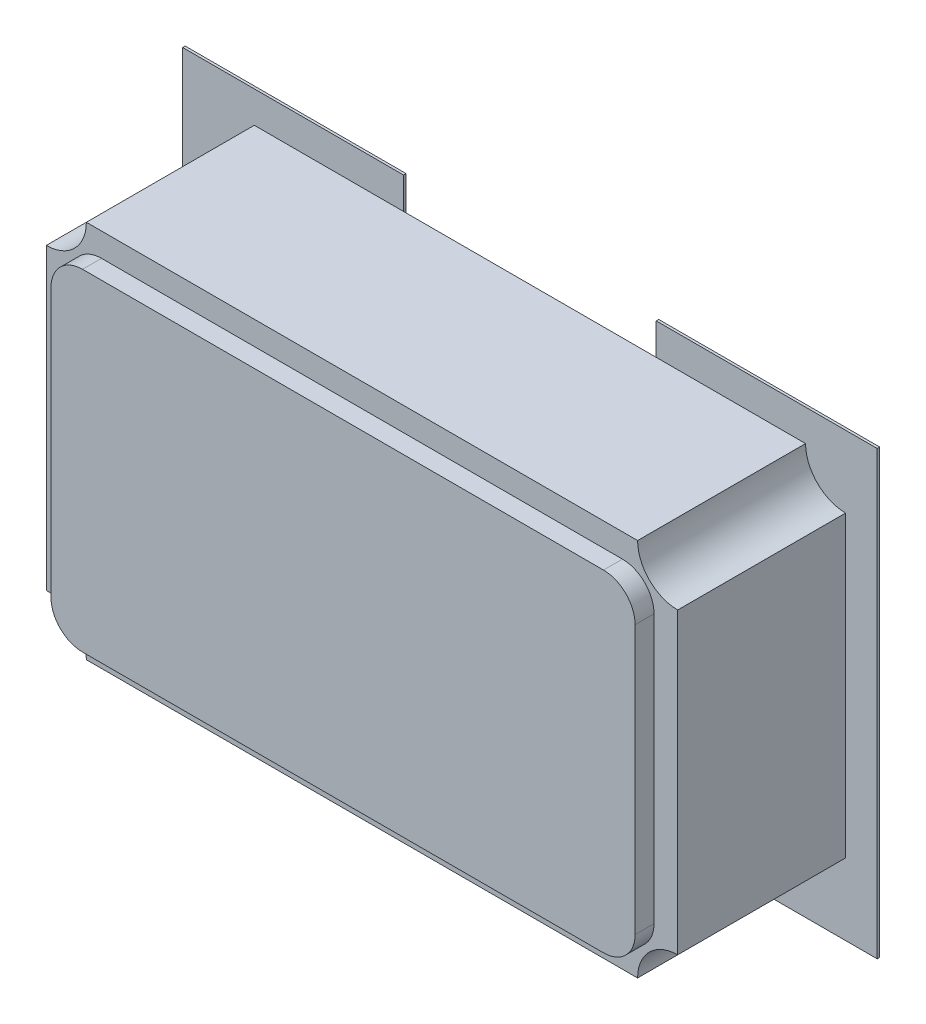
ISO-10303-21;
HEADER;
FILE_DESCRIPTION(('STEP AP214'),'2;1');
FILE_NAME('part.step','',(''),(''),'','','');
FILE_SCHEMA(('AUTOMOTIVE_DESIGN { 1 0 10303 214 1 1 1 1 }'));
ENDSEC;
DATA;
#1=APPLICATION_CONTEXT('core data for automotive mechanical design processes');
#2=APPLICATION_PROTOCOL_DEFINITION('international standard','automotive_design',2000,#1);
#3=PRODUCT_CONTEXT('',#1,'mechanical');
#4=PRODUCT('Part','Part','',(#3));
#5=PRODUCT_RELATED_PRODUCT_CATEGORY('part','',(#4));
#6=PRODUCT_DEFINITION_FORMATION('','',#4);
#7=PRODUCT_DEFINITION_CONTEXT('part definition',#1,'design');
#8=PRODUCT_DEFINITION('design','',#6,#7);
#9=PRODUCT_DEFINITION_SHAPE('','',#8);
#10=(LENGTH_UNIT() NAMED_UNIT(*) SI_UNIT(.MILLI.,.METRE.));
#11=(NAMED_UNIT(*) PLANE_ANGLE_UNIT() SI_UNIT($,.RADIAN.));
#12=(NAMED_UNIT(*) SI_UNIT($,.STERADIAN.) SOLID_ANGLE_UNIT());
#13=UNCERTAINTY_MEASURE_WITH_UNIT(LENGTH_MEASURE(1.E-05),#10,'distance_accuracy_value','');
#14=(GEOMETRIC_REPRESENTATION_CONTEXT(3) GLOBAL_UNCERTAINTY_ASSIGNED_CONTEXT((#13)) GLOBAL_UNIT_ASSIGNED_CONTEXT((#10,
#11,#12)) REPRESENTATION_CONTEXT('',''));
#15=CARTESIAN_POINT('',(0.,0.,0.));
#16=DIRECTION('',(0.,0.,1.));
#17=DIRECTION('',(1.,0.,0.));
#18=AXIS2_PLACEMENT_3D('',#15,#16,#17);
#19=CARTESIAN_POINT('',(0.,0.,0.0762));
#20=DIRECTION('',(0.,0.,1.));
#21=DIRECTION('',(1.,0.,0.));
#22=AXIS2_PLACEMENT_3D('',#19,#20,#21);
#23=PLANE('',#22);
#24=DIRECTION('',(0.,1.,0.));
#25=VECTOR('',#24,1.);
#26=CARTESIAN_POINT('',(1.09999999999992,0.699999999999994,0.0762));
#27=LINE('',#26,#25);
#28=CARTESIAN_POINT('',(1.09999999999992,-0.699999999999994,0.0762));
#29=VERTEX_POINT('',#28);
#30=CARTESIAN_POINT('',(1.09999999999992,0.699999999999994,0.0762));
#31=VERTEX_POINT('',#30);
#32=EDGE_CURVE('E171',#29,#31,#27,.T.);
#33=ORIENTED_EDGE('',*,*,#32,.F.);
#34=DIRECTION('',(1.,0.,0.));
#35=VECTOR('',#34,1.);
#36=CARTESIAN_POINT('',(1.09999999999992,-0.699999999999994,0.0762));
#37=LINE('',#36,#35);
#38=CARTESIAN_POINT('',(0.399999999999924,-0.699999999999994,0.0762));
#39=VERTEX_POINT('',#38);
#40=EDGE_CURVE('E193',#39,#29,#37,.T.);
#41=ORIENTED_EDGE('',*,*,#40,.F.);
#42=DIRECTION('',(0.,1.,0.));
#43=VECTOR('',#42,1.);
#44=CARTESIAN_POINT('',(0.399999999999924,-0.699999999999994,0.0762));
#45=LINE('',#44,#43);
#46=CARTESIAN_POINT('',(0.399999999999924,0.699999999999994,0.0762));
#47=VERTEX_POINT('',#46);
#48=EDGE_CURVE('E174',#47,#39,#45,.F.);
#49=ORIENTED_EDGE('',*,*,#48,.F.);
#50=DIRECTION('',(1.,0.,0.));
#51=VECTOR('',#50,1.);
#52=CARTESIAN_POINT('',(0.399999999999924,0.699999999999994,0.0762));
#53=LINE('',#52,#51);
#54=EDGE_CURVE('E168',#31,#47,#53,.F.);
#55=ORIENTED_EDGE('',*,*,#54,.F.);
#56=EDGE_LOOP('',(#33,#41,#49,#55));
#57=FACE_BOUND('',#56,.T.);
#58=ADVANCED_FACE('F16',(#57),#23,.F.);
#59=CARTESIAN_POINT('',(0.,0.,0.0762));
#60=DIRECTION('',(0.,0.,1.));
#61=DIRECTION('',(1.,0.,0.));
#62=AXIS2_PLACEMENT_3D('',#59,#60,#61);
#63=PLANE('',#62);
#64=DIRECTION('',(0.,1.,0.));
#65=VECTOR('',#64,1.);
#66=CARTESIAN_POINT('',(-1.09999999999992,-0.699999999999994,0.0762));
#67=LINE('',#66,#65);
#68=CARTESIAN_POINT('',(-1.09999999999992,0.699999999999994,0.0762));
#69=VERTEX_POINT('',#68);
#70=CARTESIAN_POINT('',(-1.09999999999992,-0.699999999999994,0.0762));
#71=VERTEX_POINT('',#70);
#72=EDGE_CURVE('E330',#69,#71,#67,.F.);
#73=ORIENTED_EDGE('',*,*,#72,.F.);
#74=DIRECTION('',(1.,0.,0.));
#75=VECTOR('',#74,1.);
#76=CARTESIAN_POINT('',(0.,0.699999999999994,0.0762));
#77=LINE('',#76,#75);
#78=CARTESIAN_POINT('',(-0.399999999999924,0.699999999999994,0.0762));
#79=VERTEX_POINT('',#78);
#80=EDGE_CURVE('E179',#79,#69,#77,.F.);
#81=ORIENTED_EDGE('',*,*,#80,.F.);
#82=DIRECTION('',(0.,1.,0.));
#83=VECTOR('',#82,1.);
#84=CARTESIAN_POINT('',(-0.399999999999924,0.699999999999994,0.0762));
#85=LINE('',#84,#83);
#86=CARTESIAN_POINT('',(-0.399999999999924,-0.699999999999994,0.0762));
#87=VERTEX_POINT('',#86);
#88=EDGE_CURVE('E340',#87,#79,#85,.T.);
#89=ORIENTED_EDGE('',*,*,#88,.F.);
#90=DIRECTION('',(1.,0.,0.));
#91=VECTOR('',#90,1.);
#92=CARTESIAN_POINT('',(-0.399999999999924,-0.699999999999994,0.0762));
#93=LINE('',#92,#91);
#94=EDGE_CURVE('E336',#71,#87,#93,.T.);
#95=ORIENTED_EDGE('',*,*,#94,.F.);
#96=EDGE_LOOP('',(#73,#81,#89,#95));
#97=FACE_BOUND('',#96,.T.);
#98=ADVANCED_FACE('F760',(#97),#63,.F.);
#99=CARTESIAN_POINT('',(0.399999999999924,0.699999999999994,0.0762));
#100=DIRECTION('',(0.,1.,0.));
#101=DIRECTION('',(0.,0.,1.));
#102=AXIS2_PLACEMENT_3D('',#99,#100,#101);
#103=PLANE('',#102);
#104=DIRECTION('',(0.,0.,-1.));
#105=VECTOR('',#104,1.);
#106=CARTESIAN_POINT('',(1.09999999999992,0.699999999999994,0.0762));
#107=LINE('',#106,#105);
#108=CARTESIAN_POINT('',(1.09999999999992,0.699999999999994,0.0841999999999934));
#109=VERTEX_POINT('',#108);
#110=EDGE_CURVE('E178',#31,#109,#107,.F.);
#111=ORIENTED_EDGE('',*,*,#110,.F.);
#112=ORIENTED_EDGE('',*,*,#54,.T.);
#113=DIRECTION('',(0.,0.,1.));
#114=VECTOR('',#113,1.);
#115=CARTESIAN_POINT('',(0.399999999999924,0.699999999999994,0.0762));
#116=LINE('',#115,#114);
#117=CARTESIAN_POINT('',(0.399999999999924,0.699999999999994,0.0841999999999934));
#118=VERTEX_POINT('',#117);
#119=EDGE_CURVE('E346',#118,#47,#116,.F.);
#120=ORIENTED_EDGE('',*,*,#119,.F.);
#121=DIRECTION('',(-1.,0.,0.));
#122=VECTOR('',#121,1.);
#123=CARTESIAN_POINT('',(0.,0.699999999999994,0.0841999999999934));
#124=LINE('',#123,#122);
#125=EDGE_CURVE('E184',#118,#109,#124,.F.);
#126=ORIENTED_EDGE('',*,*,#125,.T.);
#127=EDGE_LOOP('',(#111,#112,#120,#126));
#128=FACE_BOUND('',#127,.T.);
#129=ADVANCED_FACE('F182',(#128),#103,.T.);
#130=CARTESIAN_POINT('',(1.09999999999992,0.699999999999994,0.0762));
#131=DIRECTION('',(1.,0.,0.));
#132=DIRECTION('',(0.,0.,-1.));
#133=AXIS2_PLACEMENT_3D('',#130,#131,#132);
#134=PLANE('',#133);
#135=DIRECTION('',(0.,0.,-1.));
#136=VECTOR('',#135,1.);
#137=CARTESIAN_POINT('',(1.09999999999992,-0.699999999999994,0.0762));
#138=LINE('',#137,#136);
#139=CARTESIAN_POINT('',(1.09999999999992,-0.699999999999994,0.0841999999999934));
#140=VERTEX_POINT('',#139);
#141=EDGE_CURVE('E190',#29,#140,#138,.F.);
#142=ORIENTED_EDGE('',*,*,#141,.F.);
#143=ORIENTED_EDGE('',*,*,#32,.T.);
#144=ORIENTED_EDGE('',*,*,#110,.T.);
#145=DIRECTION('',(0.,1.,0.));
#146=VECTOR('',#145,1.);
#147=CARTESIAN_POINT('',(1.09999999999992,0.,0.0841999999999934));
#148=LINE('',#147,#146);
#149=EDGE_CURVE('E359',#109,#140,#148,.F.);
#150=ORIENTED_EDGE('',*,*,#149,.T.);
#151=EDGE_LOOP('',(#142,#143,#144,#150));
#152=FACE_BOUND('',#151,.T.);
#153=ADVANCED_FACE('F188',(#152),#134,.T.);
#154=CARTESIAN_POINT('',(1.09999999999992,-0.699999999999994,0.0762));
#155=DIRECTION('',(0.,-1.,0.));
#156=DIRECTION('',(0.,0.,-1.));
#157=AXIS2_PLACEMENT_3D('',#154,#155,#156);
#158=PLANE('',#157);
#159=DIRECTION('',(0.,0.,1.));
#160=VECTOR('',#159,1.);
#161=CARTESIAN_POINT('',(0.399999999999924,-0.699999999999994,0.0762));
#162=LINE('',#161,#160);
#163=CARTESIAN_POINT('',(0.399999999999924,-0.699999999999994,0.0841999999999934));
#164=VERTEX_POINT('',#163);
#165=EDGE_CURVE('E352',#39,#164,#162,.T.);
#166=ORIENTED_EDGE('',*,*,#165,.F.);
#167=ORIENTED_EDGE('',*,*,#40,.T.);
#168=ORIENTED_EDGE('',*,*,#141,.T.);
#169=DIRECTION('',(-1.,0.,0.));
#170=VECTOR('',#169,1.);
#171=CARTESIAN_POINT('',(0.,-0.699999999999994,0.0841999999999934));
#172=LINE('',#171,#170);
#173=EDGE_CURVE('E319',#140,#164,#172,.T.);
#174=ORIENTED_EDGE('',*,*,#173,.T.);
#175=EDGE_LOOP('',(#166,#167,#168,#174));
#176=FACE_BOUND('',#175,.T.);
#177=ADVANCED_FACE('F430',(#176),#158,.T.);
#178=CARTESIAN_POINT('',(-0.399999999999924,0.699999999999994,0.0762));
#179=DIRECTION('',(1.,0.,0.));
#180=DIRECTION('',(0.,0.,-1.));
#181=AXIS2_PLACEMENT_3D('',#178,#179,#180);
#182=PLANE('',#181);
#183=DIRECTION('',(0.,1.,0.));
#184=VECTOR('',#183,1.);
#185=CARTESIAN_POINT('',(-0.399999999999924,0.,0.0841999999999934));
#186=LINE('',#185,#184);
#187=CARTESIAN_POINT('',(-0.399999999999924,-0.599999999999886,0.0841999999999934));
#188=VERTEX_POINT('',#187);
#189=CARTESIAN_POINT('',(-0.399999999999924,0.599999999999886,0.0841999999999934));
#190=VERTEX_POINT('',#189);
#191=EDGE_CURVE('E283',#188,#190,#186,.T.);
#192=ORIENTED_EDGE('',*,*,#191,.F.);
#193=DIRECTION('',(0.,1.,0.));
#194=VECTOR('',#193,1.);
#195=CARTESIAN_POINT('',(-0.399999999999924,0.699999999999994,0.0841999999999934));
#196=LINE('',#195,#194);
#197=CARTESIAN_POINT('',(-0.399999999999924,-0.699999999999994,0.0841999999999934));
#198=VERTEX_POINT('',#197);
#199=EDGE_CURVE('E343',#188,#198,#196,.F.);
#200=ORIENTED_EDGE('',*,*,#199,.T.);
#201=DIRECTION('',(0.,0.,-1.));
#202=VECTOR('',#201,1.);
#203=CARTESIAN_POINT('',(-0.399999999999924,-0.699999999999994,0.0762));
#204=LINE('',#203,#202);
#205=EDGE_CURVE('E339',#87,#198,#204,.F.);
#206=ORIENTED_EDGE('',*,*,#205,.F.);
#207=ORIENTED_EDGE('',*,*,#88,.T.);
#208=DIRECTION('',(0.,0.,1.));
#209=VECTOR('',#208,1.);
#210=CARTESIAN_POINT('',(-0.399999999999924,0.699999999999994,0.0762));
#211=LINE('',#210,#209);
#212=CARTESIAN_POINT('',(-0.399999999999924,0.699999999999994,0.0841999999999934));
#213=VERTEX_POINT('',#212);
#214=EDGE_CURVE('E329',#213,#79,#211,.F.);
#215=ORIENTED_EDGE('',*,*,#214,.F.);
#216=DIRECTION('',(0.,1.,0.));
#217=VECTOR('',#216,1.);
#218=CARTESIAN_POINT('',(-0.399999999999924,0.699999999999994,0.0841999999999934));
#219=LINE('',#218,#217);
#220=EDGE_CURVE('E140',#213,#190,#219,.F.);
#221=ORIENTED_EDGE('',*,*,#220,.T.);
#222=EDGE_LOOP('',(#192,#200,#206,#207,#215,#221));
#223=FACE_BOUND('',#222,.T.);
#224=ADVANCED_FACE('F445',(#223),#182,.T.);
#225=CARTESIAN_POINT('',(0.399999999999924,-0.699999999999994,0.0762));
#226=DIRECTION('',(-1.,0.,0.));
#227=DIRECTION('',(0.,0.,1.));
#228=AXIS2_PLACEMENT_3D('',#225,#226,#227);
#229=PLANE('',#228);
#230=DIRECTION('',(0.,1.,0.));
#231=VECTOR('',#230,1.);
#232=CARTESIAN_POINT('',(0.399999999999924,0.,0.0841999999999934));
#233=LINE('',#232,#231);
#234=CARTESIAN_POINT('',(0.399999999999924,0.599999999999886,0.0841999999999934));
#235=VERTEX_POINT('',#234);
#236=CARTESIAN_POINT('',(0.399999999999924,-0.599999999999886,0.0841999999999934));
#237=VERTEX_POINT('',#236);
#238=EDGE_CURVE('E286',#235,#237,#233,.F.);
#239=ORIENTED_EDGE('',*,*,#238,.F.);
#240=DIRECTION('',(0.,1.,0.));
#241=VECTOR('',#240,1.);
#242=CARTESIAN_POINT('',(0.399999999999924,0.,0.0841999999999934));
#243=LINE('',#242,#241);
#244=EDGE_CURVE('E300',#235,#118,#243,.T.);
#245=ORIENTED_EDGE('',*,*,#244,.T.);
#246=ORIENTED_EDGE('',*,*,#119,.T.);
#247=ORIENTED_EDGE('',*,*,#48,.T.);
#248=ORIENTED_EDGE('',*,*,#165,.T.);
#249=DIRECTION('',(0.,1.,0.));
#250=VECTOR('',#249,1.);
#251=CARTESIAN_POINT('',(0.399999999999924,0.,0.0841999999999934));
#252=LINE('',#251,#250);
#253=EDGE_CURVE('E287',#164,#237,#252,.T.);
#254=ORIENTED_EDGE('',*,*,#253,.T.);
#255=EDGE_LOOP('',(#239,#245,#246,#247,#248,#254));
#256=FACE_BOUND('',#255,.T.);
#257=ADVANCED_FACE('F420',(#256),#229,.T.);
#258=CARTESIAN_POINT('',(-0.399999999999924,-0.699999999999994,0.0762));
#259=DIRECTION('',(0.,-1.,0.));
#260=DIRECTION('',(0.,0.,-1.));
#261=AXIS2_PLACEMENT_3D('',#258,#259,#260);
#262=PLANE('',#261);
#263=DIRECTION('',(0.,0.,1.));
#264=VECTOR('',#263,1.);
#265=CARTESIAN_POINT('',(-1.09999999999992,-0.699999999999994,0.0762));
#266=LINE('',#265,#264);
#267=CARTESIAN_POINT('',(-1.09999999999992,-0.699999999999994,0.0841999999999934));
#268=VERTEX_POINT('',#267);
#269=EDGE_CURVE('E333',#71,#268,#266,.T.);
#270=ORIENTED_EDGE('',*,*,#269,.F.);
#271=ORIENTED_EDGE('',*,*,#94,.T.);
#272=ORIENTED_EDGE('',*,*,#205,.T.);
#273=DIRECTION('',(-1.,0.,0.));
#274=VECTOR('',#273,1.);
#275=CARTESIAN_POINT('',(0.,-0.699999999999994,0.0841999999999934));
#276=LINE('',#275,#274);
#277=EDGE_CURVE('E282',#198,#268,#276,.T.);
#278=ORIENTED_EDGE('',*,*,#277,.T.);
#279=EDGE_LOOP('',(#270,#271,#272,#278));
#280=FACE_BOUND('',#279,.T.);
#281=ADVANCED_FACE('F709',(#280),#262,.T.);
#282=CARTESIAN_POINT('',(-1.09999999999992,-0.699999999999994,0.0762));
#283=DIRECTION('',(-1.,0.,0.));
#284=DIRECTION('',(0.,0.,1.));
#285=AXIS2_PLACEMENT_3D('',#282,#283,#284);
#286=PLANE('',#285);
#287=DIRECTION('',(0.,0.,1.));
#288=VECTOR('',#287,1.);
#289=CARTESIAN_POINT('',(-1.09999999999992,0.699999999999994,0.0762));
#290=LINE('',#289,#288);
#291=CARTESIAN_POINT('',(-1.09999999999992,0.699999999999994,0.0841999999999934));
#292=VERTEX_POINT('',#291);
#293=EDGE_CURVE('E326',#69,#292,#290,.T.);
#294=ORIENTED_EDGE('',*,*,#293,.F.);
#295=ORIENTED_EDGE('',*,*,#72,.T.);
#296=ORIENTED_EDGE('',*,*,#269,.T.);
#297=DIRECTION('',(0.,1.,0.));
#298=VECTOR('',#297,1.);
#299=CARTESIAN_POINT('',(-1.09999999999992,0.,0.0841999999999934));
#300=LINE('',#299,#298);
#301=EDGE_CURVE('E270',#268,#292,#300,.T.);
#302=ORIENTED_EDGE('',*,*,#301,.T.);
#303=EDGE_LOOP('',(#294,#295,#296,#302));
#304=FACE_BOUND('',#303,.T.);
#305=ADVANCED_FACE('F700',(#304),#286,.T.);
#306=CARTESIAN_POINT('',(-1.09999999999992,0.699999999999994,0.0762));
#307=DIRECTION('',(0.,1.,0.));
#308=DIRECTION('',(0.,0.,1.));
#309=AXIS2_PLACEMENT_3D('',#306,#307,#308);
#310=PLANE('',#309);
#311=ORIENTED_EDGE('',*,*,#214,.T.);
#312=ORIENTED_EDGE('',*,*,#80,.T.);
#313=ORIENTED_EDGE('',*,*,#293,.T.);
#314=DIRECTION('',(-1.,0.,0.));
#315=VECTOR('',#314,1.);
#316=CARTESIAN_POINT('',(0.,0.699999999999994,0.0841999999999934));
#317=LINE('',#316,#315);
#318=EDGE_CURVE('E264',#292,#213,#317,.F.);
#319=ORIENTED_EDGE('',*,*,#318,.T.);
#320=EDGE_LOOP('',(#311,#312,#313,#319));
#321=FACE_BOUND('',#320,.T.);
#322=ADVANCED_FACE('F692',(#321),#310,.T.);
#323=CARTESIAN_POINT('',(0.,0.,0.0841999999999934));
#324=DIRECTION('',(0.,0.,-1.));
#325=DIRECTION('',(-1.,0.,0.));
#326=AXIS2_PLACEMENT_3D('',#323,#324,#325);
#327=PLANE('',#326);
#328=ORIENTED_EDGE('',*,*,#173,.F.);
#329=ORIENTED_EDGE('',*,*,#149,.F.);
#330=ORIENTED_EDGE('',*,*,#125,.F.);
#331=ORIENTED_EDGE('',*,*,#244,.F.);
#332=DIRECTION('',(-1.,0.,0.));
#333=VECTOR('',#332,1.);
#334=CARTESIAN_POINT('',(0.,0.599999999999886,0.0841999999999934));
#335=LINE('',#334,#333);
#336=CARTESIAN_POINT('',(0.873000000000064,0.599999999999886,0.0841999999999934));
#337=VERTEX_POINT('',#336);
#338=EDGE_CURVE('E297',#337,#235,#335,.T.);
#339=ORIENTED_EDGE('',*,*,#338,.F.);
#340=CARTESIAN_POINT('',(1.00000000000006,0.599999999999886,0.0841999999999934));
#341=DIRECTION('',(0.,0.,1.));
#342=DIRECTION('',(1.,0.,0.));
#343=AXIS2_PLACEMENT_3D('',#340,#341,#342);
#344=CIRCLE('',#343,0.127);
#345=CARTESIAN_POINT('',(1.00000000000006,0.472999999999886,0.0841999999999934));
#346=VERTEX_POINT('',#345);
#347=EDGE_CURVE('E19',#346,#337,#344,.F.);
#348=ORIENTED_EDGE('',*,*,#347,.F.);
#349=DIRECTION('',(0.,1.,0.));
#350=VECTOR('',#349,1.);
#351=CARTESIAN_POINT('',(1.00000000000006,-0.472999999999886,0.0841999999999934));
#352=LINE('',#351,#350);
#353=CARTESIAN_POINT('',(1.00000000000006,-0.472999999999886,0.0841999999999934));
#354=VERTEX_POINT('',#353);
#355=EDGE_CURVE('E294',#354,#346,#352,.T.);
#356=ORIENTED_EDGE('',*,*,#355,.F.);
#357=CARTESIAN_POINT('',(1.00000000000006,-0.599999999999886,0.0841999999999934));
#358=DIRECTION('',(0.,0.,1.));
#359=DIRECTION('',(1.,0.,0.));
#360=AXIS2_PLACEMENT_3D('',#357,#358,#359);
#361=CIRCLE('',#360,0.127);
#362=CARTESIAN_POINT('',(0.873000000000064,-0.599999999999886,0.0841999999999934));
#363=VERTEX_POINT('',#362);
#364=EDGE_CURVE('E253',#354,#363,#361,.T.);
#365=ORIENTED_EDGE('',*,*,#364,.T.);
#366=DIRECTION('',(1.,0.,0.));
#367=VECTOR('',#366,1.);
#368=CARTESIAN_POINT('',(-0.873000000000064,-0.599999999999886,0.0841999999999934));
#369=LINE('',#368,#367);
#370=EDGE_CURVE('E262',#237,#363,#369,.T.);
#371=ORIENTED_EDGE('',*,*,#370,.F.);
#372=ORIENTED_EDGE('',*,*,#253,.F.);
#373=EDGE_LOOP('',(#328,#329,#330,#331,#339,#348,#356,#365,#371,#372));
#374=FACE_BOUND('',#373,.T.);
#375=ADVANCED_FACE('F416',(#374),#327,.F.);
#376=CARTESIAN_POINT('',(0.,0.,0.0841999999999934));
#377=DIRECTION('',(0.,0.,-1.));
#378=DIRECTION('',(-1.,0.,0.));
#379=AXIS2_PLACEMENT_3D('',#376,#377,#378);
#380=PLANE('',#379);
#381=ORIENTED_EDGE('',*,*,#238,.T.);
#382=DIRECTION('',(1.,0.,0.));
#383=VECTOR('',#382,1.);
#384=CARTESIAN_POINT('',(-0.873000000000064,-0.599999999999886,0.0841999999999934));
#385=LINE('',#384,#383);
#386=EDGE_CURVE('E255',#188,#237,#385,.T.);
#387=ORIENTED_EDGE('',*,*,#386,.F.);
#388=ORIENTED_EDGE('',*,*,#191,.T.);
#389=DIRECTION('',(1.,0.,0.));
#390=VECTOR('',#389,1.);
#391=CARTESIAN_POINT('',(0.873000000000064,0.599999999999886,0.0841999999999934));
#392=LINE('',#391,#390);
#393=EDGE_CURVE('E252',#235,#190,#392,.F.);
#394=ORIENTED_EDGE('',*,*,#393,.F.);
#395=EDGE_LOOP('',(#381,#387,#388,#394));
#396=FACE_BOUND('',#395,.T.);
#397=ADVANCED_FACE('F438',(#396),#380,.T.);
#398=CARTESIAN_POINT('',(0.,0.,0.0841999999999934));
#399=DIRECTION('',(0.,0.,-1.));
#400=DIRECTION('',(-1.,0.,0.));
#401=AXIS2_PLACEMENT_3D('',#398,#399,#400);
#402=PLANE('',#401);
#403=DIRECTION('',(0.,1.,0.));
#404=VECTOR('',#403,1.);
#405=CARTESIAN_POINT('',(-1.00000000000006,0.472999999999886,0.0841999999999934));
#406=LINE('',#405,#404);
#407=CARTESIAN_POINT('',(-1.00000000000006,0.472999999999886,0.0841999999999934));
#408=VERTEX_POINT('',#407);
#409=CARTESIAN_POINT('',(-1.00000000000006,-0.472999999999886,0.0841999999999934));
#410=VERTEX_POINT('',#409);
#411=EDGE_CURVE('E258',#408,#410,#406,.F.);
#412=ORIENTED_EDGE('',*,*,#411,.F.);
#413=CARTESIAN_POINT('',(-1.00000000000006,0.599999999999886,0.0841999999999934));
#414=DIRECTION('',(0.,0.,1.));
#415=DIRECTION('',(1.,0.,0.));
#416=AXIS2_PLACEMENT_3D('',#413,#414,#415);
#417=CIRCLE('',#416,0.127);
#418=CARTESIAN_POINT('',(-0.873000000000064,0.599999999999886,0.0841999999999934));
#419=VERTEX_POINT('',#418);
#420=EDGE_CURVE('E249',#408,#419,#417,.T.);
#421=ORIENTED_EDGE('',*,*,#420,.T.);
#422=DIRECTION('',(1.,0.,0.));
#423=VECTOR('',#422,1.);
#424=CARTESIAN_POINT('',(0.873000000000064,0.599999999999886,0.0841999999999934));
#425=LINE('',#424,#423);
#426=EDGE_CURVE('E273',#190,#419,#425,.F.);
#427=ORIENTED_EDGE('',*,*,#426,.F.);
#428=ORIENTED_EDGE('',*,*,#220,.F.);
#429=ORIENTED_EDGE('',*,*,#318,.F.);
#430=ORIENTED_EDGE('',*,*,#301,.F.);
#431=ORIENTED_EDGE('',*,*,#277,.F.);
#432=ORIENTED_EDGE('',*,*,#199,.F.);
#433=DIRECTION('',(1.,0.,0.));
#434=VECTOR('',#433,1.);
#435=CARTESIAN_POINT('',(-0.873000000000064,-0.599999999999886,0.0841999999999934));
#436=LINE('',#435,#434);
#437=CARTESIAN_POINT('',(-0.873000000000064,-0.599999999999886,0.0841999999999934));
#438=VERTEX_POINT('',#437);
#439=EDGE_CURVE('E308',#438,#188,#436,.T.);
#440=ORIENTED_EDGE('',*,*,#439,.F.);
#441=CARTESIAN_POINT('',(-1.00000000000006,-0.599999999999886,0.0841999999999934));
#442=DIRECTION('',(0.,0.,1.));
#443=DIRECTION('',(1.,0.,0.));
#444=AXIS2_PLACEMENT_3D('',#441,#442,#443);
#445=CIRCLE('',#444,0.127);
#446=EDGE_CURVE('E256',#438,#410,#445,.T.);
#447=ORIENTED_EDGE('',*,*,#446,.T.);
#448=EDGE_LOOP('',(#412,#421,#427,#428,#429,#430,#431,#432,#440,#447));
#449=FACE_BOUND('',#448,.T.);
#450=ADVANCED_FACE('F442',(#449),#402,.F.);
#451=CARTESIAN_POINT('',(-1.00000000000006,0.472999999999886,0.0762));
#452=DIRECTION('',(-1.,0.,0.));
#453=DIRECTION('',(0.,0.,1.));
#454=AXIS2_PLACEMENT_3D('',#451,#452,#453);
#455=PLANE('',#454);
#456=DIRECTION('',(0.,0.,1.));
#457=VECTOR('',#456,1.);
#458=CARTESIAN_POINT('',(-1.00000000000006,0.472999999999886,0.0762));
#459=LINE('',#458,#457);
#460=CARTESIAN_POINT('',(-1.00000000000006,0.472999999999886,0.61614800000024));
#461=VERTEX_POINT('',#460);
#462=EDGE_CURVE('E452',#461,#408,#459,.F.);
#463=ORIENTED_EDGE('',*,*,#462,.T.);
#464=ORIENTED_EDGE('',*,*,#411,.T.);
#465=DIRECTION('',(0.,0.,1.));
#466=VECTOR('',#465,1.);
#467=CARTESIAN_POINT('',(-1.00000000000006,-0.472999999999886,0.0762));
#468=LINE('',#467,#466);
#469=CARTESIAN_POINT('',(-1.00000000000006,-0.472999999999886,0.61614800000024));
#470=VERTEX_POINT('',#469);
#471=EDGE_CURVE('E257',#410,#470,#468,.T.);
#472=ORIENTED_EDGE('',*,*,#471,.T.);
#473=DIRECTION('',(0.,1.,0.));
#474=VECTOR('',#473,1.);
#475=CARTESIAN_POINT('',(-1.00000000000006,0.,0.61614800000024));
#476=LINE('',#475,#474);
#477=EDGE_CURVE('E248',#461,#470,#476,.F.);
#478=ORIENTED_EDGE('',*,*,#477,.F.);
#479=EDGE_LOOP('',(#463,#464,#472,#478));
#480=FACE_BOUND('',#479,.T.);
#481=ADVANCED_FACE('F660',(#480),#455,.T.);
#482=CARTESIAN_POINT('',(-1.00000000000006,-0.599999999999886,0.0762));
#483=DIRECTION('',(0.,0.,1.));
#484=DIRECTION('',(1.,0.,0.));
#485=AXIS2_PLACEMENT_3D('',#482,#483,#484);
#486=CYLINDRICAL_SURFACE('',#485,0.127);
#487=CARTESIAN_POINT('',(-1.00000000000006,-0.599999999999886,0.61614800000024));
#488=DIRECTION('',(0.,0.,1.));
#489=DIRECTION('',(1.,0.,0.));
#490=AXIS2_PLACEMENT_3D('',#487,#488,#489);
#491=CIRCLE('',#490,0.127);
#492=CARTESIAN_POINT('',(-0.873000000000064,-0.599999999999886,0.61614800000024));
#493=VERTEX_POINT('',#492);
#494=EDGE_CURVE('E245',#470,#493,#491,.F.);
#495=ORIENTED_EDGE('',*,*,#494,.F.);
#496=ORIENTED_EDGE('',*,*,#471,.F.);
#497=ORIENTED_EDGE('',*,*,#446,.F.);
#498=DIRECTION('',(0.,0.,-1.));
#499=VECTOR('',#498,1.);
#500=CARTESIAN_POINT('',(-0.873000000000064,-0.599999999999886,0.0762));
#501=LINE('',#500,#499);
#502=EDGE_CURVE('E305',#493,#438,#501,.T.);
#503=ORIENTED_EDGE('',*,*,#502,.F.);
#504=EDGE_LOOP('',(#495,#496,#497,#503));
#505=FACE_BOUND('',#504,.T.);
#506=ADVANCED_FACE('F652',(#505),#486,.F.);
#507=CARTESIAN_POINT('',(-0.873000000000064,-0.599999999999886,0.0762));
#508=DIRECTION('',(0.,-1.,0.));
#509=DIRECTION('',(0.,0.,-1.));
#510=AXIS2_PLACEMENT_3D('',#507,#508,#509);
#511=PLANE('',#510);
#512=ORIENTED_EDGE('',*,*,#439,.T.);
#513=ORIENTED_EDGE('',*,*,#386,.T.);
#514=ORIENTED_EDGE('',*,*,#370,.T.);
#515=DIRECTION('',(0.,0.,1.));
#516=VECTOR('',#515,1.);
#517=CARTESIAN_POINT('',(0.873000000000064,-0.599999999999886,0.0762));
#518=LINE('',#517,#516);
#519=CARTESIAN_POINT('',(0.873000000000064,-0.599999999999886,0.61614800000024));
#520=VERTEX_POINT('',#519);
#521=EDGE_CURVE('E254',#363,#520,#518,.T.);
#522=ORIENTED_EDGE('',*,*,#521,.T.);
#523=DIRECTION('',(1.,0.,0.));
#524=VECTOR('',#523,1.);
#525=CARTESIAN_POINT('',(0.,-0.599999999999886,0.61614800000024));
#526=LINE('',#525,#524);
#527=EDGE_CURVE('E244',#493,#520,#526,.T.);
#528=ORIENTED_EDGE('',*,*,#527,.F.);
#529=ORIENTED_EDGE('',*,*,#502,.T.);
#530=EDGE_LOOP('',(#512,#513,#514,#522,#528,#529));
#531=FACE_BOUND('',#530,.T.);
#532=ADVANCED_FACE('F439',(#531),#511,.T.);
#533=CARTESIAN_POINT('',(1.00000000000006,-0.599999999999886,0.0762));
#534=DIRECTION('',(0.,0.,1.));
#535=DIRECTION('',(1.,0.,0.));
#536=AXIS2_PLACEMENT_3D('',#533,#534,#535);
#537=CYLINDRICAL_SURFACE('',#536,0.127);
#538=CARTESIAN_POINT('',(1.00000000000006,-0.599999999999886,0.61614800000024));
#539=DIRECTION('',(0.,0.,1.));
#540=DIRECTION('',(1.,0.,0.));
#541=AXIS2_PLACEMENT_3D('',#538,#539,#540);
#542=CIRCLE('',#541,0.127);
#543=CARTESIAN_POINT('',(1.00000000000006,-0.472999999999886,0.61614800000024));
#544=VERTEX_POINT('',#543);
#545=EDGE_CURVE('E241',#520,#544,#542,.F.);
#546=ORIENTED_EDGE('',*,*,#545,.F.);
#547=ORIENTED_EDGE('',*,*,#521,.F.);
#548=ORIENTED_EDGE('',*,*,#364,.F.);
#549=DIRECTION('',(0.,0.,-1.));
#550=VECTOR('',#549,1.);
#551=CARTESIAN_POINT('',(1.00000000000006,-0.472999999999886,0.0762));
#552=LINE('',#551,#550);
#553=EDGE_CURVE('E296',#544,#354,#552,.T.);
#554=ORIENTED_EDGE('',*,*,#553,.F.);
#555=EDGE_LOOP('',(#546,#547,#548,#554));
#556=FACE_BOUND('',#555,.T.);
#557=ADVANCED_FACE('F464',(#556),#537,.F.);
#558=CARTESIAN_POINT('',(1.00000000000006,-0.472999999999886,0.0762));
#559=DIRECTION('',(1.,0.,0.));
#560=DIRECTION('',(0.,0.,-1.));
#561=AXIS2_PLACEMENT_3D('',#558,#559,#560);
#562=PLANE('',#561);
#563=ORIENTED_EDGE('',*,*,#553,.T.);
#564=ORIENTED_EDGE('',*,*,#355,.T.);
#565=DIRECTION('',(0.,0.,1.));
#566=VECTOR('',#565,1.);
#567=CARTESIAN_POINT('',(1.00000000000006,0.472999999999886,0.0762));
#568=LINE('',#567,#566);
#569=CARTESIAN_POINT('',(1.00000000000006,0.472999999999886,0.61614800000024));
#570=VERTEX_POINT('',#569);
#571=EDGE_CURVE('E277',#346,#570,#568,.T.);
#572=ORIENTED_EDGE('',*,*,#571,.T.);
#573=DIRECTION('',(0.,1.,0.));
#574=VECTOR('',#573,1.);
#575=CARTESIAN_POINT('',(1.00000000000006,0.,0.61614800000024));
#576=LINE('',#575,#574);
#577=EDGE_CURVE('E240',#544,#570,#576,.T.);
#578=ORIENTED_EDGE('',*,*,#577,.F.);
#579=EDGE_LOOP('',(#563,#564,#572,#578));
#580=FACE_BOUND('',#579,.T.);
#581=ADVANCED_FACE('F496',(#580),#562,.T.);
#582=CARTESIAN_POINT('',(1.00000000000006,0.599999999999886,0.0762));
#583=DIRECTION('',(0.,0.,1.));
#584=DIRECTION('',(1.,0.,0.));
#585=AXIS2_PLACEMENT_3D('',#582,#583,#584);
#586=CYLINDRICAL_SURFACE('',#585,0.127);
#587=CARTESIAN_POINT('',(1.00000000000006,0.599999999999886,0.61614800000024));
#588=DIRECTION('',(0.,0.,1.));
#589=DIRECTION('',(1.,0.,0.));
#590=AXIS2_PLACEMENT_3D('',#587,#588,#589);
#591=CIRCLE('',#590,0.127);
#592=CARTESIAN_POINT('',(0.873000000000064,0.599999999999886,0.61614800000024));
#593=VERTEX_POINT('',#592);
#594=EDGE_CURVE('E237',#570,#593,#591,.F.);
#595=ORIENTED_EDGE('',*,*,#594,.F.);
#596=ORIENTED_EDGE('',*,*,#571,.F.);
#597=ORIENTED_EDGE('',*,*,#347,.T.);
#598=DIRECTION('',(0.,0.,1.));
#599=VECTOR('',#598,1.);
#600=CARTESIAN_POINT('',(0.873000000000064,0.599999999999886,0.0762));
#601=LINE('',#600,#599);
#602=EDGE_CURVE('E276',#593,#337,#601,.F.);
#603=ORIENTED_EDGE('',*,*,#602,.F.);
#604=EDGE_LOOP('',(#595,#596,#597,#603));
#605=FACE_BOUND('',#604,.T.);
#606=ADVANCED_FACE('F406',(#605),#586,.F.);
#607=CARTESIAN_POINT('',(0.873000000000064,0.599999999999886,0.0762));
#608=DIRECTION('',(0.,1.,0.));
#609=DIRECTION('',(0.,0.,1.));
#610=AXIS2_PLACEMENT_3D('',#607,#608,#609);
#611=PLANE('',#610);
#612=ORIENTED_EDGE('',*,*,#338,.T.);
#613=ORIENTED_EDGE('',*,*,#393,.T.);
#614=ORIENTED_EDGE('',*,*,#426,.T.);
#615=DIRECTION('',(0.,0.,1.));
#616=VECTOR('',#615,1.);
#617=CARTESIAN_POINT('',(-0.873000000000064,0.599999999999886,0.0762));
#618=LINE('',#617,#616);
#619=CARTESIAN_POINT('',(-0.873000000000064,0.599999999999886,0.61614800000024));
#620=VERTEX_POINT('',#619);
#621=EDGE_CURVE('E251',#419,#620,#618,.T.);
#622=ORIENTED_EDGE('',*,*,#621,.T.);
#623=DIRECTION('',(1.,0.,0.));
#624=VECTOR('',#623,1.);
#625=CARTESIAN_POINT('',(0.,0.599999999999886,0.61614800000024));
#626=LINE('',#625,#624);
#627=EDGE_CURVE('E236',#593,#620,#626,.F.);
#628=ORIENTED_EDGE('',*,*,#627,.F.);
#629=ORIENTED_EDGE('',*,*,#602,.T.);
#630=EDGE_LOOP('',(#612,#613,#614,#622,#628,#629));
#631=FACE_BOUND('',#630,.T.);
#632=ADVANCED_FACE('F410',(#631),#611,.T.);
#633=CARTESIAN_POINT('',(-1.00000000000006,0.599999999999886,0.0762));
#634=DIRECTION('',(0.,0.,1.));
#635=DIRECTION('',(1.,0.,0.));
#636=AXIS2_PLACEMENT_3D('',#633,#634,#635);
#637=CYLINDRICAL_SURFACE('',#636,0.127);
#638=CARTESIAN_POINT('',(-1.00000000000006,0.599999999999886,0.61614800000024));
#639=DIRECTION('',(0.,0.,1.));
#640=DIRECTION('',(1.,0.,0.));
#641=AXIS2_PLACEMENT_3D('',#638,#639,#640);
#642=CIRCLE('',#641,0.127);
#643=EDGE_CURVE('E233',#620,#461,#642,.F.);
#644=ORIENTED_EDGE('',*,*,#643,.F.);
#645=ORIENTED_EDGE('',*,*,#621,.F.);
#646=ORIENTED_EDGE('',*,*,#420,.F.);
#647=ORIENTED_EDGE('',*,*,#462,.F.);
#648=EDGE_LOOP('',(#644,#645,#646,#647));
#649=FACE_BOUND('',#648,.T.);
#650=ADVANCED_FACE('F450',(#649),#637,.F.);
#651=CARTESIAN_POINT('',(0.,0.,0.61614800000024));
#652=DIRECTION('',(0.,0.,1.));
#653=DIRECTION('',(1.,0.,0.));
#654=AXIS2_PLACEMENT_3D('',#651,#652,#653);
#655=PLANE('',#654);
#656=CARTESIAN_POINT('',(-0.825000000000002,0.425000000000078,0.61614800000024));
#657=DIRECTION('',(0.,0.,1.));
#658=DIRECTION('',(1.,0.,0.));
#659=AXIS2_PLACEMENT_3D('',#656,#657,#658);
#660=CIRCLE('',#659,0.100000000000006);
#661=CARTESIAN_POINT('',(-0.825000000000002,0.524999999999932,0.61614800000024));
#662=VERTEX_POINT('',#661);
#663=CARTESIAN_POINT('',(-0.92500000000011,0.425000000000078,0.61614800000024));
#664=VERTEX_POINT('',#663);
#665=EDGE_CURVE('E229',#662,#664,#660,.T.);
#666=ORIENTED_EDGE('',*,*,#665,.F.);
#667=DIRECTION('',(1.,0.,0.));
#668=VECTOR('',#667,1.);
#669=CARTESIAN_POINT('',(-0.825000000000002,0.524999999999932,0.61614800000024));
#670=LINE('',#669,#668);
#671=CARTESIAN_POINT('',(0.825000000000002,0.524999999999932,0.61614800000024));
#672=VERTEX_POINT('',#671);
#673=EDGE_CURVE('E494',#662,#672,#670,.T.);
#674=ORIENTED_EDGE('',*,*,#673,.T.);
#675=CARTESIAN_POINT('',(0.825000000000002,0.425000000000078,0.61614800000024));
#676=DIRECTION('',(0.,0.,1.));
#677=DIRECTION('',(1.,0.,0.));
#678=AXIS2_PLACEMENT_3D('',#675,#676,#677);
#679=CIRCLE('',#678,0.100000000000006);
#680=CARTESIAN_POINT('',(0.925000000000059,0.425000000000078,0.61614800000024));
#681=VERTEX_POINT('',#680);
#682=EDGE_CURVE('E215',#681,#672,#679,.T.);
#683=ORIENTED_EDGE('',*,*,#682,.F.);
#684=DIRECTION('',(0.,1.,0.));
#685=VECTOR('',#684,1.);
#686=CARTESIAN_POINT('',(0.92500000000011,0.425000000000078,0.61614800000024));
#687=LINE('',#686,#685);
#688=CARTESIAN_POINT('',(0.92500000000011,-0.425000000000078,0.61614800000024));
#689=VERTEX_POINT('',#688);
#690=EDGE_CURVE('E222',#681,#689,#687,.F.);
#691=ORIENTED_EDGE('',*,*,#690,.T.);
#692=CARTESIAN_POINT('',(0.825000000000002,-0.425000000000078,0.61614800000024));
#693=DIRECTION('',(0.,0.,1.));
#694=DIRECTION('',(1.,0.,0.));
#695=AXIS2_PLACEMENT_3D('',#692,#693,#694);
#696=CIRCLE('',#695,0.100000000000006);
#697=CARTESIAN_POINT('',(0.825000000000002,-0.525000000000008,0.61614800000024));
#698=VERTEX_POINT('',#697);
#699=EDGE_CURVE('E219',#698,#689,#696,.T.);
#700=ORIENTED_EDGE('',*,*,#699,.F.);
#701=DIRECTION('',(1.,0.,0.));
#702=VECTOR('',#701,1.);
#703=CARTESIAN_POINT('',(0.825000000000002,-0.524999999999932,0.61614800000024));
#704=LINE('',#703,#702);
#705=CARTESIAN_POINT('',(-0.825000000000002,-0.524999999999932,0.61614800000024));
#706=VERTEX_POINT('',#705);
#707=EDGE_CURVE('E227',#698,#706,#704,.F.);
#708=ORIENTED_EDGE('',*,*,#707,.T.);
#709=CARTESIAN_POINT('',(-0.825000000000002,-0.425000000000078,0.61614800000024));
#710=DIRECTION('',(0.,0.,1.));
#711=DIRECTION('',(1.,0.,0.));
#712=AXIS2_PLACEMENT_3D('',#709,#710,#711);
#713=CIRCLE('',#712,0.100000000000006);
#714=CARTESIAN_POINT('',(-0.925000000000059,-0.425000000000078,0.61614800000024));
#715=VERTEX_POINT('',#714);
#716=EDGE_CURVE('E224',#715,#706,#713,.T.);
#717=ORIENTED_EDGE('',*,*,#716,.F.);
#718=DIRECTION('',(0.,1.,0.));
#719=VECTOR('',#718,1.);
#720=CARTESIAN_POINT('',(-0.92500000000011,-0.425000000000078,0.61614800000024));
#721=LINE('',#720,#719);
#722=EDGE_CURVE('E232',#715,#664,#721,.T.);
#723=ORIENTED_EDGE('',*,*,#722,.T.);
#724=EDGE_LOOP('',(#666,#674,#683,#691,#700,#708,#717,#723));
#725=FACE_BOUND('',#724,.T.);
#726=ORIENTED_EDGE('',*,*,#627,.T.);
#727=ORIENTED_EDGE('',*,*,#643,.T.);
#728=ORIENTED_EDGE('',*,*,#477,.T.);
#729=ORIENTED_EDGE('',*,*,#494,.T.);
#730=ORIENTED_EDGE('',*,*,#527,.T.);
#731=ORIENTED_EDGE('',*,*,#545,.T.);
#732=ORIENTED_EDGE('',*,*,#577,.T.);
#733=ORIENTED_EDGE('',*,*,#594,.T.);
#734=EDGE_LOOP('',(#726,#727,#728,#729,#730,#731,#732,#733));
#735=FACE_BOUND('',#734,.T.);
#736=ADVANCED_FACE('F468',(#725,#735),#655,.T.);
#737=CARTESIAN_POINT('',(-0.825000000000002,0.425000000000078,0.676148));
#738=DIRECTION('',(0.,0.,1.));
#739=DIRECTION('',(1.,0.,0.));
#740=AXIS2_PLACEMENT_3D('',#737,#738,#739);
#741=CYLINDRICAL_SURFACE('',#740,0.100000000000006);
#742=DIRECTION('',(0.,0.,-1.));
#743=VECTOR('',#742,1.);
#744=CARTESIAN_POINT('',(-0.92500000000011,0.425000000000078,0.676148));
#745=LINE('',#744,#743);
#746=CARTESIAN_POINT('',(-0.92500000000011,0.425000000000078,0.676148));
#747=VERTEX_POINT('',#746);
#748=EDGE_CURVE('E492',#664,#747,#745,.F.);
#749=ORIENTED_EDGE('',*,*,#748,.T.);
#750=CARTESIAN_POINT('',(-0.825000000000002,0.425000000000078,0.676148));
#751=DIRECTION('',(0.,0.,1.));
#752=DIRECTION('',(1.,0.,0.));
#753=AXIS2_PLACEMENT_3D('',#750,#751,#752);
#754=CIRCLE('',#753,0.100000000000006);
#755=CARTESIAN_POINT('',(-0.825000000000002,0.524999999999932,0.676148));
#756=VERTEX_POINT('',#755);
#757=EDGE_CURVE('E212',#756,#747,#754,.T.);
#758=ORIENTED_EDGE('',*,*,#757,.F.);
#759=DIRECTION('',(0.,0.,-1.));
#760=VECTOR('',#759,1.);
#761=CARTESIAN_POINT('',(-0.825000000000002,0.524999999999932,0.676148));
#762=LINE('',#761,#760);
#763=EDGE_CURVE('E217',#756,#662,#762,.T.);
#764=ORIENTED_EDGE('',*,*,#763,.T.);
#765=ORIENTED_EDGE('',*,*,#665,.T.);
#766=EDGE_LOOP('',(#749,#758,#764,#765));
#767=FACE_BOUND('',#766,.T.);
#768=ADVANCED_FACE('F538',(#767),#741,.T.);
#769=CARTESIAN_POINT('',(-0.92500000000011,-0.425000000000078,0.676148));
#770=DIRECTION('',(1.,0.,0.));
#771=DIRECTION('',(0.,0.,-1.));
#772=AXIS2_PLACEMENT_3D('',#769,#770,#771);
#773=PLANE('',#772);
#774=ORIENTED_EDGE('',*,*,#722,.F.);
#775=DIRECTION('',(0.,0.,1.));
#776=VECTOR('',#775,1.);
#777=CARTESIAN_POINT('',(-0.925000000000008,-0.425000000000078,0.676148));
#778=LINE('',#777,#776);
#779=CARTESIAN_POINT('',(-0.925000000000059,-0.425000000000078,0.676148));
#780=VERTEX_POINT('',#779);
#781=EDGE_CURVE('E228',#780,#715,#778,.F.);
#782=ORIENTED_EDGE('',*,*,#781,.F.);
#783=DIRECTION('',(0.,1.,0.));
#784=VECTOR('',#783,1.);
#785=CARTESIAN_POINT('',(-0.92500000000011,0.,0.676148));
#786=LINE('',#785,#784);
#787=EDGE_CURVE('E211',#747,#780,#786,.F.);
#788=ORIENTED_EDGE('',*,*,#787,.F.);
#789=ORIENTED_EDGE('',*,*,#748,.F.);
#790=EDGE_LOOP('',(#774,#782,#788,#789));
#791=FACE_BOUND('',#790,.T.);
#792=ADVANCED_FACE('F535',(#791),#773,.F.);
#793=CARTESIAN_POINT('',(-0.825000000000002,-0.425000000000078,0.676148));
#794=DIRECTION('',(0.,0.,1.));
#795=DIRECTION('',(1.,0.,0.));
#796=AXIS2_PLACEMENT_3D('',#793,#794,#795);
#797=CYLINDRICAL_SURFACE('',#796,0.100000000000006);
#798=DIRECTION('',(0.,0.,1.));
#799=VECTOR('',#798,1.);
#800=CARTESIAN_POINT('',(-0.825000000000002,-0.524999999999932,0.676148));
#801=LINE('',#800,#799);
#802=CARTESIAN_POINT('',(-0.825000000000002,-0.524999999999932,0.676148));
#803=VERTEX_POINT('',#802);
#804=EDGE_CURVE('E477',#706,#803,#801,.T.);
#805=ORIENTED_EDGE('',*,*,#804,.T.);
#806=CARTESIAN_POINT('',(-0.825000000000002,-0.425000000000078,0.676148));
#807=DIRECTION('',(0.,0.,1.));
#808=DIRECTION('',(1.,0.,0.));
#809=AXIS2_PLACEMENT_3D('',#806,#807,#808);
#810=CIRCLE('',#809,0.100000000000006);
#811=EDGE_CURVE('E208',#780,#803,#810,.T.);
#812=ORIENTED_EDGE('',*,*,#811,.F.);
#813=ORIENTED_EDGE('',*,*,#781,.T.);
#814=ORIENTED_EDGE('',*,*,#716,.T.);
#815=EDGE_LOOP('',(#805,#812,#813,#814));
#816=FACE_BOUND('',#815,.T.);
#817=ADVANCED_FACE('F531',(#816),#797,.T.);
#818=CARTESIAN_POINT('',(0.825000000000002,-0.524999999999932,0.676148));
#819=DIRECTION('',(0.,1.,0.));
#820=DIRECTION('',(0.,0.,1.));
#821=AXIS2_PLACEMENT_3D('',#818,#819,#820);
#822=PLANE('',#821);
#823=ORIENTED_EDGE('',*,*,#707,.F.);
#824=DIRECTION('',(0.,0.,1.));
#825=VECTOR('',#824,1.);
#826=CARTESIAN_POINT('',(0.825000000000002,-0.525000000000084,0.676148));
#827=LINE('',#826,#825);
#828=CARTESIAN_POINT('',(0.825000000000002,-0.525000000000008,0.676148));
#829=VERTEX_POINT('',#828);
#830=EDGE_CURVE('E223',#829,#698,#827,.F.);
#831=ORIENTED_EDGE('',*,*,#830,.F.);
#832=DIRECTION('',(1.,0.,0.));
#833=VECTOR('',#832,1.);
#834=CARTESIAN_POINT('',(0.,-0.524999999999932,0.676148));
#835=LINE('',#834,#833);
#836=EDGE_CURVE('E207',#803,#829,#835,.T.);
#837=ORIENTED_EDGE('',*,*,#836,.F.);
#838=ORIENTED_EDGE('',*,*,#804,.F.);
#839=EDGE_LOOP('',(#823,#831,#837,#838));
#840=FACE_BOUND('',#839,.T.);
#841=ADVANCED_FACE('F527',(#840),#822,.F.);
#842=CARTESIAN_POINT('',(0.825000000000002,-0.425000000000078,0.676148));
#843=DIRECTION('',(0.,0.,1.));
#844=DIRECTION('',(1.,0.,0.));
#845=AXIS2_PLACEMENT_3D('',#842,#843,#844);
#846=CYLINDRICAL_SURFACE('',#845,0.100000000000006);
#847=DIRECTION('',(0.,0.,1.));
#848=VECTOR('',#847,1.);
#849=CARTESIAN_POINT('',(0.92500000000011,-0.425000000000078,0.676148));
#850=LINE('',#849,#848);
#851=CARTESIAN_POINT('',(0.92500000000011,-0.425000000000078,0.676148));
#852=VERTEX_POINT('',#851);
#853=EDGE_CURVE('E476',#689,#852,#850,.T.);
#854=ORIENTED_EDGE('',*,*,#853,.T.);
#855=CARTESIAN_POINT('',(0.825000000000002,-0.425000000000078,0.676148));
#856=DIRECTION('',(0.,0.,1.));
#857=DIRECTION('',(1.,0.,0.));
#858=AXIS2_PLACEMENT_3D('',#855,#856,#857);
#859=CIRCLE('',#858,0.100000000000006);
#860=EDGE_CURVE('E204',#829,#852,#859,.T.);
#861=ORIENTED_EDGE('',*,*,#860,.F.);
#862=ORIENTED_EDGE('',*,*,#830,.T.);
#863=ORIENTED_EDGE('',*,*,#699,.T.);
#864=EDGE_LOOP('',(#854,#861,#862,#863));
#865=FACE_BOUND('',#864,.T.);
#866=ADVANCED_FACE('F523',(#865),#846,.T.);
#867=CARTESIAN_POINT('',(0.92500000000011,0.425000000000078,0.676148));
#868=DIRECTION('',(-1.,0.,0.));
#869=DIRECTION('',(0.,0.,1.));
#870=AXIS2_PLACEMENT_3D('',#867,#868,#869);
#871=PLANE('',#870);
#872=ORIENTED_EDGE('',*,*,#690,.F.);
#873=DIRECTION('',(0.,0.,1.));
#874=VECTOR('',#873,1.);
#875=CARTESIAN_POINT('',(0.925000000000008,0.425000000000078,0.676148));
#876=LINE('',#875,#874);
#877=CARTESIAN_POINT('',(0.925000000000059,0.425000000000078,0.676148));
#878=VERTEX_POINT('',#877);
#879=EDGE_CURVE('E218',#878,#681,#876,.F.);
#880=ORIENTED_EDGE('',*,*,#879,.F.);
#881=DIRECTION('',(0.,1.,0.));
#882=VECTOR('',#881,1.);
#883=CARTESIAN_POINT('',(0.92500000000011,0.,0.676148));
#884=LINE('',#883,#882);
#885=EDGE_CURVE('E203',#852,#878,#884,.T.);
#886=ORIENTED_EDGE('',*,*,#885,.F.);
#887=ORIENTED_EDGE('',*,*,#853,.F.);
#888=EDGE_LOOP('',(#872,#880,#886,#887));
#889=FACE_BOUND('',#888,.T.);
#890=ADVANCED_FACE('F520',(#889),#871,.F.);
#891=CARTESIAN_POINT('',(0.825000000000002,0.425000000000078,0.676148));
#892=DIRECTION('',(0.,0.,1.));
#893=DIRECTION('',(1.,0.,0.));
#894=AXIS2_PLACEMENT_3D('',#891,#892,#893);
#895=CYLINDRICAL_SURFACE('',#894,0.100000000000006);
#896=DIRECTION('',(0.,0.,-1.));
#897=VECTOR('',#896,1.);
#898=CARTESIAN_POINT('',(0.825000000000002,0.524999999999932,0.676148));
#899=LINE('',#898,#897);
#900=CARTESIAN_POINT('',(0.825000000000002,0.524999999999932,0.676148));
#901=VERTEX_POINT('',#900);
#902=EDGE_CURVE('E34',#672,#901,#899,.F.);
#903=ORIENTED_EDGE('',*,*,#902,.T.);
#904=CARTESIAN_POINT('',(0.825000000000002,0.425000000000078,0.676148));
#905=DIRECTION('',(0.,0.,1.));
#906=DIRECTION('',(1.,0.,0.));
#907=AXIS2_PLACEMENT_3D('',#904,#905,#906);
#908=CIRCLE('',#907,0.100000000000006);
#909=EDGE_CURVE('E25',#878,#901,#908,.T.);
#910=ORIENTED_EDGE('',*,*,#909,.F.);
#911=ORIENTED_EDGE('',*,*,#879,.T.);
#912=ORIENTED_EDGE('',*,*,#682,.T.);
#913=EDGE_LOOP('',(#903,#910,#911,#912));
#914=FACE_BOUND('',#913,.T.);
#915=ADVANCED_FACE('F514',(#914),#895,.T.);
#916=CARTESIAN_POINT('',(-0.825000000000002,0.524999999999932,0.676148));
#917=DIRECTION('',(0.,-1.,0.));
#918=DIRECTION('',(0.,0.,-1.));
#919=AXIS2_PLACEMENT_3D('',#916,#917,#918);
#920=PLANE('',#919);
#921=ORIENTED_EDGE('',*,*,#673,.F.);
#922=ORIENTED_EDGE('',*,*,#763,.F.);
#923=DIRECTION('',(1.,0.,0.));
#924=VECTOR('',#923,1.);
#925=CARTESIAN_POINT('',(0.,0.524999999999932,0.676148));
#926=LINE('',#925,#924);
#927=EDGE_CURVE('E11',#901,#756,#926,.F.);
#928=ORIENTED_EDGE('',*,*,#927,.F.);
#929=ORIENTED_EDGE('',*,*,#902,.F.);
#930=EDGE_LOOP('',(#921,#922,#928,#929));
#931=FACE_BOUND('',#930,.T.);
#932=ADVANCED_FACE('F508',(#931),#920,.F.);
#933=CARTESIAN_POINT('',(0.,0.,0.676148));
#934=DIRECTION('',(0.,0.,1.));
#935=DIRECTION('',(1.,0.,0.));
#936=AXIS2_PLACEMENT_3D('',#933,#934,#935);
#937=PLANE('',#936);
#938=ORIENTED_EDGE('',*,*,#909,.T.);
#939=ORIENTED_EDGE('',*,*,#927,.T.);
#940=ORIENTED_EDGE('',*,*,#757,.T.);
#941=ORIENTED_EDGE('',*,*,#787,.T.);
#942=ORIENTED_EDGE('',*,*,#811,.T.);
#943=ORIENTED_EDGE('',*,*,#836,.T.);
#944=ORIENTED_EDGE('',*,*,#860,.T.);
#945=ORIENTED_EDGE('',*,*,#885,.T.);
#946=EDGE_LOOP('',(#938,#939,#940,#941,#942,#943,#944,#945));
#947=FACE_BOUND('',#946,.T.);
#948=ADVANCED_FACE('F506',(#947),#937,.T.);
#949=CLOSED_SHELL('',(#58,#98,#129,#153,#177,#224,#257,#281,#305,#322,#375,#397,#450,#481,#506,
#532,#557,#581,#606,#632,#650,#736,#768,#792,#817,#841,#866,#890,#915,#932,#948));
#950=MANIFOLD_SOLID_BREP('B1',#949);
#951=ADVANCED_BREP_SHAPE_REPRESENTATION('',(#18,#950),#14);
#952=SHAPE_DEFINITION_REPRESENTATION(#9,#951);
ENDSEC;
END-ISO-10303-21;
